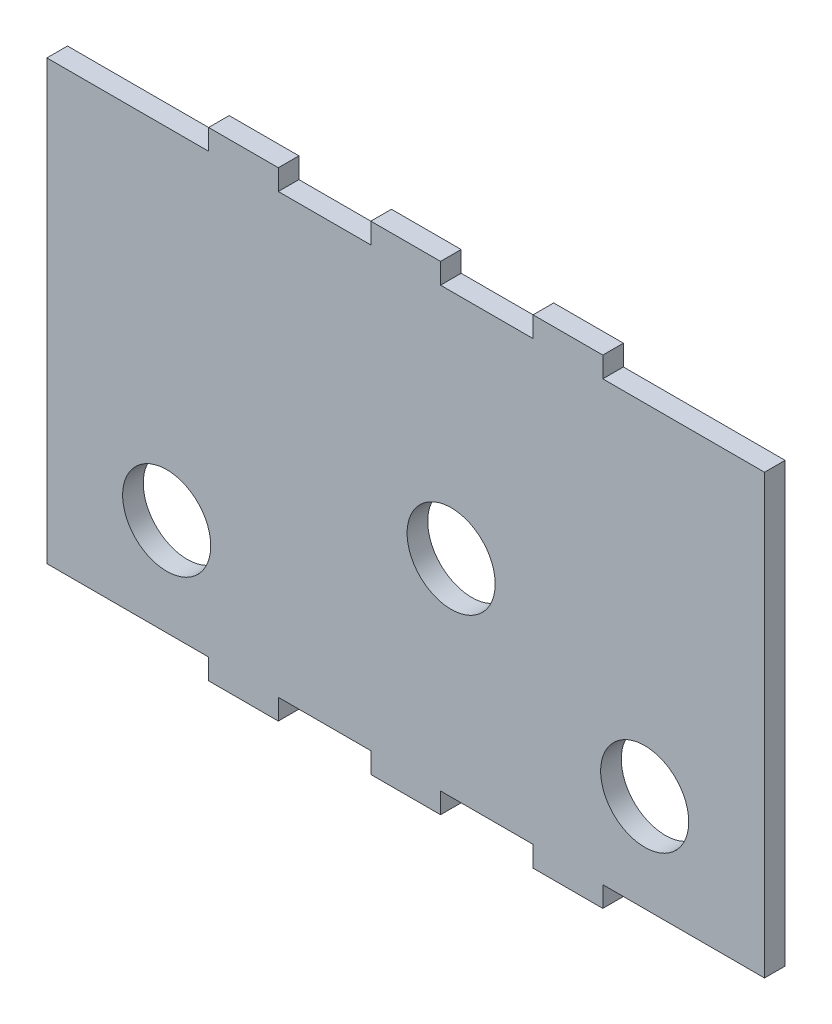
ISO-10303-21;
HEADER;
FILE_DESCRIPTION(('STEP AP214'),'2;1');
FILE_NAME('part.step','',(''),(''),'','','');
FILE_SCHEMA(('AUTOMOTIVE_DESIGN { 1 0 10303 214 1 1 1 1 }'));
ENDSEC;
DATA;
#1=APPLICATION_CONTEXT('core data for automotive mechanical design processes');
#2=APPLICATION_PROTOCOL_DEFINITION('international standard','automotive_design',2000,#1);
#3=PRODUCT_CONTEXT('',#1,'mechanical');
#4=PRODUCT('Part','Part','',(#3));
#5=PRODUCT_RELATED_PRODUCT_CATEGORY('part','',(#4));
#6=PRODUCT_DEFINITION_FORMATION('','',#4);
#7=PRODUCT_DEFINITION_CONTEXT('part definition',#1,'design');
#8=PRODUCT_DEFINITION('design','',#6,#7);
#9=PRODUCT_DEFINITION_SHAPE('','',#8);
#10=(LENGTH_UNIT() NAMED_UNIT(*) SI_UNIT(.MILLI.,.METRE.));
#11=(NAMED_UNIT(*) PLANE_ANGLE_UNIT() SI_UNIT($,.RADIAN.));
#12=(NAMED_UNIT(*) SI_UNIT($,.STERADIAN.) SOLID_ANGLE_UNIT());
#13=UNCERTAINTY_MEASURE_WITH_UNIT(LENGTH_MEASURE(1.E-05),#10,'distance_accuracy_value','');
#14=(GEOMETRIC_REPRESENTATION_CONTEXT(3) GLOBAL_UNCERTAINTY_ASSIGNED_CONTEXT((#13)) GLOBAL_UNIT_ASSIGNED_CONTEXT((#10,
#11,#12)) REPRESENTATION_CONTEXT('',''));
#15=CARTESIAN_POINT('',(0.,0.,0.));
#16=DIRECTION('',(0.,0.,1.));
#17=DIRECTION('',(1.,0.,0.));
#18=AXIS2_PLACEMENT_3D('',#15,#16,#17);
#19=CARTESIAN_POINT('',(0.,0.,6.35));
#20=DIRECTION('',(0.,0.,1.));
#21=DIRECTION('',(1.,0.,0.));
#22=AXIS2_PLACEMENT_3D('',#19,#20,#21);
#23=PLANE('',#22);
#24=CARTESIAN_POINT('',(184.2425,30.,6.35));
#25=DIRECTION('',(0.,0.,1.));
#26=DIRECTION('',(1.,0.,0.));
#27=AXIS2_PLACEMENT_3D('',#24,#25,#26);
#28=CIRCLE('',#27,13.575);
#29=CARTESIAN_POINT('',(197.8175,30.,6.35));
#30=VERTEX_POINT('',#29);
#31=EDGE_CURVE('E586',#30,#30,#28,.T.);
#32=ORIENTED_EDGE('',*,*,#31,.F.);
#33=EDGE_LOOP('',(#32));
#34=FACE_BOUND('',#33,.T.);
#35=DIRECTION('',(1.,0.,0.));
#36=VECTOR('',#35,1.);
#37=CARTESIAN_POINT('',(99.84,0.,6.35));
#38=LINE('',#37,#36);
#39=CARTESIAN_POINT('',(71.325,0.,6.35));
#40=VERTEX_POINT('',#39);
#41=CARTESIAN_POINT('',(99.84,0.,6.35));
#42=VERTEX_POINT('',#41);
#43=EDGE_CURVE('E347',#40,#42,#38,.T.);
#44=ORIENTED_EDGE('',*,*,#43,.T.);
#45=DIRECTION('',(0.,-1.,0.));
#46=VECTOR('',#45,1.);
#47=CARTESIAN_POINT('',(99.84,0.,6.35));
#48=LINE('',#47,#46);
#49=CARTESIAN_POINT('',(99.84,-6.34999999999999,6.35));
#50=VERTEX_POINT('',#49);
#51=EDGE_CURVE('E163',#42,#50,#48,.T.);
#52=ORIENTED_EDGE('',*,*,#51,.T.);
#53=DIRECTION('',(1.,0.,0.));
#54=VECTOR('',#53,1.);
#55=CARTESIAN_POINT('',(99.84,-6.34999999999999,6.35));
#56=LINE('',#55,#54);
#57=CARTESIAN_POINT('',(121.325,-6.34999999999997,6.35));
#58=VERTEX_POINT('',#57);
#59=EDGE_CURVE('E448',#50,#58,#56,.T.);
#60=ORIENTED_EDGE('',*,*,#59,.T.);
#61=DIRECTION('',(0.,1.,0.));
#62=VECTOR('',#61,1.);
#63=CARTESIAN_POINT('',(121.325,-6.34999999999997,6.35));
#64=LINE('',#63,#62);
#65=CARTESIAN_POINT('',(121.325,0.,6.35));
#66=VERTEX_POINT('',#65);
#67=EDGE_CURVE('E468',#58,#66,#64,.T.);
#68=ORIENTED_EDGE('',*,*,#67,.T.);
#69=DIRECTION('',(1.,0.,0.));
#70=VECTOR('',#69,1.);
#71=CARTESIAN_POINT('',(121.325,0.,6.35));
#72=LINE('',#71,#70);
#73=CARTESIAN_POINT('',(149.84,0.,6.35));
#74=VERTEX_POINT('',#73);
#75=EDGE_CURVE('E464',#66,#74,#72,.T.);
#76=ORIENTED_EDGE('',*,*,#75,.T.);
#77=DIRECTION('',(0.,-1.,0.));
#78=VECTOR('',#77,1.);
#79=CARTESIAN_POINT('',(149.84,0.,6.35));
#80=LINE('',#79,#78);
#81=CARTESIAN_POINT('',(149.84,-6.35000000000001,6.35));
#82=VERTEX_POINT('',#81);
#83=EDGE_CURVE('E467',#74,#82,#80,.T.);
#84=ORIENTED_EDGE('',*,*,#83,.T.);
#85=DIRECTION('',(1.,0.,0.));
#86=VECTOR('',#85,1.);
#87=CARTESIAN_POINT('',(149.84,-6.35000000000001,6.35));
#88=LINE('',#87,#86);
#89=CARTESIAN_POINT('',(171.325,-6.35000000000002,6.35));
#90=VERTEX_POINT('',#89);
#91=EDGE_CURVE('E472',#82,#90,#88,.T.);
#92=ORIENTED_EDGE('',*,*,#91,.T.);
#93=DIRECTION('',(0.,1.,0.));
#94=VECTOR('',#93,1.);
#95=CARTESIAN_POINT('',(171.325,-6.35000000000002,6.35));
#96=LINE('',#95,#94);
#97=CARTESIAN_POINT('',(171.325,0.,6.35));
#98=VERTEX_POINT('',#97);
#99=EDGE_CURVE('E479',#90,#98,#96,.T.);
#100=ORIENTED_EDGE('',*,*,#99,.T.);
#101=DIRECTION('',(1.,0.,0.));
#102=VECTOR('',#101,1.);
#103=CARTESIAN_POINT('',(171.325,0.,6.35));
#104=LINE('',#103,#102);
#105=CARTESIAN_POINT('',(221.165,0.,6.35));
#106=VERTEX_POINT('',#105);
#107=EDGE_CURVE('E482',#98,#106,#104,.T.);
#108=ORIENTED_EDGE('',*,*,#107,.T.);
#109=DIRECTION('',(0.,1.,0.));
#110=VECTOR('',#109,1.);
#111=CARTESIAN_POINT('',(221.165,0.,6.35));
#112=LINE('',#111,#110);
#113=CARTESIAN_POINT('',(221.165,135.,6.35));
#114=VERTEX_POINT('',#113);
#115=EDGE_CURVE('E485',#106,#114,#112,.T.);
#116=ORIENTED_EDGE('',*,*,#115,.T.);
#117=DIRECTION('',(-1.,0.,0.));
#118=VECTOR('',#117,1.);
#119=CARTESIAN_POINT('',(171.325,135.,6.35));
#120=LINE('',#119,#118);
#121=CARTESIAN_POINT('',(171.325,135.,6.35));
#122=VERTEX_POINT('',#121);
#123=EDGE_CURVE('E488',#114,#122,#120,.T.);
#124=ORIENTED_EDGE('',*,*,#123,.T.);
#125=DIRECTION('',(0.,1.,0.));
#126=VECTOR('',#125,1.);
#127=CARTESIAN_POINT('',(171.325,141.35,6.35));
#128=LINE('',#127,#126);
#129=CARTESIAN_POINT('',(171.325,141.35,6.35));
#130=VERTEX_POINT('',#129);
#131=EDGE_CURVE('E491',#122,#130,#128,.T.);
#132=ORIENTED_EDGE('',*,*,#131,.T.);
#133=DIRECTION('',(-1.,0.,0.));
#134=VECTOR('',#133,1.);
#135=CARTESIAN_POINT('',(149.84,141.35,6.35));
#136=LINE('',#135,#134);
#137=CARTESIAN_POINT('',(149.84,141.35,6.35));
#138=VERTEX_POINT('',#137);
#139=EDGE_CURVE('E494',#130,#138,#136,.T.);
#140=ORIENTED_EDGE('',*,*,#139,.T.);
#141=DIRECTION('',(0.,-1.,0.));
#142=VECTOR('',#141,1.);
#143=CARTESIAN_POINT('',(149.84,135.,6.35));
#144=LINE('',#143,#142);
#145=CARTESIAN_POINT('',(149.84,135.,6.35));
#146=VERTEX_POINT('',#145);
#147=EDGE_CURVE('E497',#138,#146,#144,.T.);
#148=ORIENTED_EDGE('',*,*,#147,.T.);
#149=DIRECTION('',(-1.,0.,0.));
#150=VECTOR('',#149,1.);
#151=CARTESIAN_POINT('',(121.325,135.,6.35));
#152=LINE('',#151,#150);
#153=CARTESIAN_POINT('',(121.325,135.,6.35));
#154=VERTEX_POINT('',#153);
#155=EDGE_CURVE('E500',#146,#154,#152,.T.);
#156=ORIENTED_EDGE('',*,*,#155,.T.);
#157=DIRECTION('',(0.,1.,0.));
#158=VECTOR('',#157,1.);
#159=CARTESIAN_POINT('',(121.325,141.35,6.35));
#160=LINE('',#159,#158);
#161=CARTESIAN_POINT('',(121.325,141.35,6.35));
#162=VERTEX_POINT('',#161);
#163=EDGE_CURVE('E503',#154,#162,#160,.T.);
#164=ORIENTED_EDGE('',*,*,#163,.T.);
#165=DIRECTION('',(-1.,0.,0.));
#166=VECTOR('',#165,1.);
#167=CARTESIAN_POINT('',(99.8399999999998,141.35,6.35));
#168=LINE('',#167,#166);
#169=CARTESIAN_POINT('',(99.8399999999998,141.35,6.35));
#170=VERTEX_POINT('',#169);
#171=EDGE_CURVE('E506',#162,#170,#168,.T.);
#172=ORIENTED_EDGE('',*,*,#171,.T.);
#173=DIRECTION('',(0.,-1.,0.));
#174=VECTOR('',#173,1.);
#175=CARTESIAN_POINT('',(99.8399999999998,135.,6.35));
#176=LINE('',#175,#174);
#177=CARTESIAN_POINT('',(99.8399999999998,135.,6.35));
#178=VERTEX_POINT('',#177);
#179=EDGE_CURVE('E509',#170,#178,#176,.T.);
#180=ORIENTED_EDGE('',*,*,#179,.T.);
#181=DIRECTION('',(-1.,0.,0.));
#182=VECTOR('',#181,1.);
#183=CARTESIAN_POINT('',(99.8399999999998,135.,6.35));
#184=LINE('',#183,#182);
#185=CARTESIAN_POINT('',(71.3249999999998,135.,6.35));
#186=VERTEX_POINT('',#185);
#187=EDGE_CURVE('E512',#178,#186,#184,.T.);
#188=ORIENTED_EDGE('',*,*,#187,.T.);
#189=DIRECTION('',(0.,1.,0.));
#190=VECTOR('',#189,1.);
#191=CARTESIAN_POINT('',(71.3249999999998,135.,6.35));
#192=LINE('',#191,#190);
#193=CARTESIAN_POINT('',(71.325,141.35,6.35));
#194=VERTEX_POINT('',#193);
#195=EDGE_CURVE('E515',#186,#194,#192,.T.);
#196=ORIENTED_EDGE('',*,*,#195,.T.);
#197=DIRECTION('',(-1.,0.,0.));
#198=VECTOR('',#197,1.);
#199=CARTESIAN_POINT('',(71.325,141.35,6.35));
#200=LINE('',#199,#198);
#201=CARTESIAN_POINT('',(49.84,141.35,6.35));
#202=VERTEX_POINT('',#201);
#203=EDGE_CURVE('E518',#194,#202,#200,.T.);
#204=ORIENTED_EDGE('',*,*,#203,.T.);
#205=DIRECTION('',(0.,-1.,0.));
#206=VECTOR('',#205,1.);
#207=CARTESIAN_POINT('',(49.84,141.35,6.35));
#208=LINE('',#207,#206);
#209=CARTESIAN_POINT('',(49.8399999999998,135.,6.35));
#210=VERTEX_POINT('',#209);
#211=EDGE_CURVE('E521',#202,#210,#208,.T.);
#212=ORIENTED_EDGE('',*,*,#211,.T.);
#213=DIRECTION('',(-1.,0.,0.));
#214=VECTOR('',#213,1.);
#215=CARTESIAN_POINT('',(49.8399999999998,135.,6.35));
#216=LINE('',#215,#214);
#217=CARTESIAN_POINT('',(0.,135.,6.35));
#218=VERTEX_POINT('',#217);
#219=EDGE_CURVE('E524',#210,#218,#216,.T.);
#220=ORIENTED_EDGE('',*,*,#219,.T.);
#221=DIRECTION('',(0.,-1.,0.));
#222=VECTOR('',#221,1.);
#223=CARTESIAN_POINT('',(0.,0.,6.35));
#224=LINE('',#223,#222);
#225=CARTESIAN_POINT('',(0.,0.,6.35));
#226=VERTEX_POINT('',#225);
#227=EDGE_CURVE('E527',#218,#226,#224,.T.);
#228=ORIENTED_EDGE('',*,*,#227,.T.);
#229=DIRECTION('',(1.,0.,0.));
#230=VECTOR('',#229,1.);
#231=CARTESIAN_POINT('',(49.84,0.,6.35));
#232=LINE('',#231,#230);
#233=CARTESIAN_POINT('',(49.84,0.,6.35));
#234=VERTEX_POINT('',#233);
#235=EDGE_CURVE('E242',#226,#234,#232,.T.);
#236=ORIENTED_EDGE('',*,*,#235,.T.);
#237=DIRECTION('',(0.,-1.,0.));
#238=VECTOR('',#237,1.);
#239=CARTESIAN_POINT('',(49.84,-6.35000000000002,6.35));
#240=LINE('',#239,#238);
#241=CARTESIAN_POINT('',(49.84,-6.35000000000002,6.35));
#242=VERTEX_POINT('',#241);
#243=EDGE_CURVE('E236',#234,#242,#240,.T.);
#244=ORIENTED_EDGE('',*,*,#243,.T.);
#245=DIRECTION('',(1.,0.,0.));
#246=VECTOR('',#245,1.);
#247=CARTESIAN_POINT('',(71.325,-6.34999999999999,6.35));
#248=LINE('',#247,#246);
#249=CARTESIAN_POINT('',(71.325,-6.34999999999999,6.35));
#250=VERTEX_POINT('',#249);
#251=EDGE_CURVE('E240',#242,#250,#248,.T.);
#252=ORIENTED_EDGE('',*,*,#251,.T.);
#253=DIRECTION('',(0.,1.,0.));
#254=VECTOR('',#253,1.);
#255=CARTESIAN_POINT('',(71.325,0.,6.35));
#256=LINE('',#255,#254);
#257=EDGE_CURVE('E60',#250,#40,#256,.T.);
#258=ORIENTED_EDGE('',*,*,#257,.T.);
#259=EDGE_LOOP('',(#44,#52,#60,#68,#76,#84,#92,#100,#108,#116,#124,#132,#140,#148,#156,#164,
#172,#180,#188,#196,#204,#212,#220,#228,#236,#244,#252,#258));
#260=FACE_BOUND('',#259,.T.);
#261=CARTESIAN_POINT('',(36.9225,30.,6.35));
#262=DIRECTION('',(0.,0.,1.));
#263=DIRECTION('',(1.,0.,0.));
#264=AXIS2_PLACEMENT_3D('',#261,#262,#263);
#265=CIRCLE('',#264,13.575);
#266=CARTESIAN_POINT('',(50.4975,30.,6.35));
#267=VERTEX_POINT('',#266);
#268=EDGE_CURVE('E269',#267,#267,#265,.T.);
#269=ORIENTED_EDGE('',*,*,#268,.F.);
#270=EDGE_LOOP('',(#269));
#271=FACE_BOUND('',#270,.T.);
#272=CARTESIAN_POINT('',(124.588874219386,63.6703865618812,6.35));
#273=DIRECTION('',(0.,0.,1.));
#274=DIRECTION('',(1.,0.,0.));
#275=AXIS2_PLACEMENT_3D('',#272,#273,#274);
#276=CIRCLE('',#275,13.575);
#277=CARTESIAN_POINT('',(138.163874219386,63.6703865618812,6.35));
#278=VERTEX_POINT('',#277);
#279=EDGE_CURVE('E575',#278,#278,#276,.T.);
#280=ORIENTED_EDGE('',*,*,#279,.F.);
#281=EDGE_LOOP('',(#280));
#282=FACE_BOUND('',#281,.T.);
#283=ADVANCED_FACE('F42',(#34,#260,#271,#282),#23,.T.);
#284=CARTESIAN_POINT('',(0.,0.,0.));
#285=DIRECTION('',(0.,0.,1.));
#286=DIRECTION('',(1.,0.,0.));
#287=AXIS2_PLACEMENT_3D('',#284,#285,#286);
#288=PLANE('',#287);
#289=DIRECTION('',(1.,0.,0.));
#290=VECTOR('',#289,1.);
#291=CARTESIAN_POINT('',(99.84,0.,0.));
#292=LINE('',#291,#290);
#293=CARTESIAN_POINT('',(71.325,0.,0.));
#294=VERTEX_POINT('',#293);
#295=CARTESIAN_POINT('',(99.84,0.,0.));
#296=VERTEX_POINT('',#295);
#297=EDGE_CURVE('E264',#294,#296,#292,.T.);
#298=ORIENTED_EDGE('',*,*,#297,.F.);
#299=DIRECTION('',(0.,1.,0.));
#300=VECTOR('',#299,1.);
#301=CARTESIAN_POINT('',(71.325,0.,0.));
#302=LINE('',#301,#300);
#303=CARTESIAN_POINT('',(71.325,-6.34999999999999,0.));
#304=VERTEX_POINT('',#303);
#305=EDGE_CURVE('E155',#304,#294,#302,.T.);
#306=ORIENTED_EDGE('',*,*,#305,.F.);
#307=DIRECTION('',(1.,0.,0.));
#308=VECTOR('',#307,1.);
#309=CARTESIAN_POINT('',(71.325,-6.34999999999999,0.));
#310=LINE('',#309,#308);
#311=CARTESIAN_POINT('',(49.84,-6.35000000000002,0.));
#312=VERTEX_POINT('',#311);
#313=EDGE_CURVE('E149',#312,#304,#310,.T.);
#314=ORIENTED_EDGE('',*,*,#313,.F.);
#315=DIRECTION('',(0.,-1.,0.));
#316=VECTOR('',#315,1.);
#317=CARTESIAN_POINT('',(49.84,-6.35000000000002,0.));
#318=LINE('',#317,#316);
#319=CARTESIAN_POINT('',(49.84,0.,0.));
#320=VERTEX_POINT('',#319);
#321=EDGE_CURVE('E251',#320,#312,#318,.T.);
#322=ORIENTED_EDGE('',*,*,#321,.F.);
#323=DIRECTION('',(1.,0.,0.));
#324=VECTOR('',#323,1.);
#325=CARTESIAN_POINT('',(49.84,0.,0.));
#326=LINE('',#325,#324);
#327=CARTESIAN_POINT('',(0.,0.,0.));
#328=VERTEX_POINT('',#327);
#329=EDGE_CURVE('E338',#328,#320,#326,.T.);
#330=ORIENTED_EDGE('',*,*,#329,.F.);
#331=DIRECTION('',(0.,-1.,0.));
#332=VECTOR('',#331,1.);
#333=CARTESIAN_POINT('',(0.,0.,0.));
#334=LINE('',#333,#332);
#335=CARTESIAN_POINT('',(0.,135.,0.));
#336=VERTEX_POINT('',#335);
#337=EDGE_CURVE('E335',#336,#328,#334,.T.);
#338=ORIENTED_EDGE('',*,*,#337,.F.);
#339=DIRECTION('',(-1.,0.,0.));
#340=VECTOR('',#339,1.);
#341=CARTESIAN_POINT('',(49.8399999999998,135.,0.));
#342=LINE('',#341,#340);
#343=CARTESIAN_POINT('',(49.8399999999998,135.,0.));
#344=VERTEX_POINT('',#343);
#345=EDGE_CURVE('E332',#344,#336,#342,.T.);
#346=ORIENTED_EDGE('',*,*,#345,.F.);
#347=DIRECTION('',(0.,-1.,0.));
#348=VECTOR('',#347,1.);
#349=CARTESIAN_POINT('',(49.84,141.35,0.));
#350=LINE('',#349,#348);
#351=CARTESIAN_POINT('',(49.84,141.35,0.));
#352=VERTEX_POINT('',#351);
#353=EDGE_CURVE('E329',#352,#344,#350,.T.);
#354=ORIENTED_EDGE('',*,*,#353,.F.);
#355=DIRECTION('',(-1.,0.,0.));
#356=VECTOR('',#355,1.);
#357=CARTESIAN_POINT('',(71.325,141.35,0.));
#358=LINE('',#357,#356);
#359=CARTESIAN_POINT('',(71.325,141.35,0.));
#360=VERTEX_POINT('',#359);
#361=EDGE_CURVE('E326',#360,#352,#358,.T.);
#362=ORIENTED_EDGE('',*,*,#361,.F.);
#363=DIRECTION('',(0.,1.,0.));
#364=VECTOR('',#363,1.);
#365=CARTESIAN_POINT('',(71.3249999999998,135.,0.));
#366=LINE('',#365,#364);
#367=CARTESIAN_POINT('',(71.3249999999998,135.,0.));
#368=VERTEX_POINT('',#367);
#369=EDGE_CURVE('E323',#368,#360,#366,.T.);
#370=ORIENTED_EDGE('',*,*,#369,.F.);
#371=DIRECTION('',(-1.,0.,0.));
#372=VECTOR('',#371,1.);
#373=CARTESIAN_POINT('',(99.8399999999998,135.,0.));
#374=LINE('',#373,#372);
#375=CARTESIAN_POINT('',(99.8399999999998,135.,0.));
#376=VERTEX_POINT('',#375);
#377=EDGE_CURVE('E320',#376,#368,#374,.T.);
#378=ORIENTED_EDGE('',*,*,#377,.F.);
#379=DIRECTION('',(0.,-1.,0.));
#380=VECTOR('',#379,1.);
#381=CARTESIAN_POINT('',(99.8399999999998,135.,0.));
#382=LINE('',#381,#380);
#383=CARTESIAN_POINT('',(99.8399999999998,141.35,0.));
#384=VERTEX_POINT('',#383);
#385=EDGE_CURVE('E317',#384,#376,#382,.T.);
#386=ORIENTED_EDGE('',*,*,#385,.F.);
#387=DIRECTION('',(-1.,0.,0.));
#388=VECTOR('',#387,1.);
#389=CARTESIAN_POINT('',(99.8399999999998,141.35,0.));
#390=LINE('',#389,#388);
#391=CARTESIAN_POINT('',(121.325,141.35,0.));
#392=VERTEX_POINT('',#391);
#393=EDGE_CURVE('E314',#392,#384,#390,.T.);
#394=ORIENTED_EDGE('',*,*,#393,.F.);
#395=DIRECTION('',(0.,1.,0.));
#396=VECTOR('',#395,1.);
#397=CARTESIAN_POINT('',(121.325,141.35,0.));
#398=LINE('',#397,#396);
#399=CARTESIAN_POINT('',(121.325,135.,0.));
#400=VERTEX_POINT('',#399);
#401=EDGE_CURVE('E311',#400,#392,#398,.T.);
#402=ORIENTED_EDGE('',*,*,#401,.F.);
#403=DIRECTION('',(-1.,0.,0.));
#404=VECTOR('',#403,1.);
#405=CARTESIAN_POINT('',(121.325,135.,0.));
#406=LINE('',#405,#404);
#407=CARTESIAN_POINT('',(149.84,135.,0.));
#408=VERTEX_POINT('',#407);
#409=EDGE_CURVE('E308',#408,#400,#406,.T.);
#410=ORIENTED_EDGE('',*,*,#409,.F.);
#411=DIRECTION('',(0.,-1.,0.));
#412=VECTOR('',#411,1.);
#413=CARTESIAN_POINT('',(149.84,135.,0.));
#414=LINE('',#413,#412);
#415=CARTESIAN_POINT('',(149.84,141.35,0.));
#416=VERTEX_POINT('',#415);
#417=EDGE_CURVE('E305',#416,#408,#414,.T.);
#418=ORIENTED_EDGE('',*,*,#417,.F.);
#419=DIRECTION('',(-1.,0.,0.));
#420=VECTOR('',#419,1.);
#421=CARTESIAN_POINT('',(149.84,141.35,0.));
#422=LINE('',#421,#420);
#423=CARTESIAN_POINT('',(171.325,141.35,0.));
#424=VERTEX_POINT('',#423);
#425=EDGE_CURVE('E302',#424,#416,#422,.T.);
#426=ORIENTED_EDGE('',*,*,#425,.F.);
#427=DIRECTION('',(0.,1.,0.));
#428=VECTOR('',#427,1.);
#429=CARTESIAN_POINT('',(171.325,141.35,0.));
#430=LINE('',#429,#428);
#431=CARTESIAN_POINT('',(171.325,135.,0.));
#432=VERTEX_POINT('',#431);
#433=EDGE_CURVE('E299',#432,#424,#430,.T.);
#434=ORIENTED_EDGE('',*,*,#433,.F.);
#435=DIRECTION('',(-1.,0.,0.));
#436=VECTOR('',#435,1.);
#437=CARTESIAN_POINT('',(171.325,135.,0.));
#438=LINE('',#437,#436);
#439=CARTESIAN_POINT('',(221.165,135.,0.));
#440=VERTEX_POINT('',#439);
#441=EDGE_CURVE('E296',#440,#432,#438,.T.);
#442=ORIENTED_EDGE('',*,*,#441,.F.);
#443=DIRECTION('',(0.,1.,0.));
#444=VECTOR('',#443,1.);
#445=CARTESIAN_POINT('',(221.165,0.,0.));
#446=LINE('',#445,#444);
#447=CARTESIAN_POINT('',(221.165,0.,0.));
#448=VERTEX_POINT('',#447);
#449=EDGE_CURVE('E293',#448,#440,#446,.T.);
#450=ORIENTED_EDGE('',*,*,#449,.F.);
#451=DIRECTION('',(1.,0.,0.));
#452=VECTOR('',#451,1.);
#453=CARTESIAN_POINT('',(171.325,0.,0.));
#454=LINE('',#453,#452);
#455=CARTESIAN_POINT('',(171.325,0.,0.));
#456=VERTEX_POINT('',#455);
#457=EDGE_CURVE('E290',#456,#448,#454,.T.);
#458=ORIENTED_EDGE('',*,*,#457,.F.);
#459=DIRECTION('',(0.,1.,0.));
#460=VECTOR('',#459,1.);
#461=CARTESIAN_POINT('',(171.325,-6.35000000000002,0.));
#462=LINE('',#461,#460);
#463=CARTESIAN_POINT('',(171.325,-6.35000000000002,0.));
#464=VERTEX_POINT('',#463);
#465=EDGE_CURVE('E287',#464,#456,#462,.T.);
#466=ORIENTED_EDGE('',*,*,#465,.F.);
#467=DIRECTION('',(1.,0.,0.));
#468=VECTOR('',#467,1.);
#469=CARTESIAN_POINT('',(149.84,-6.35000000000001,0.));
#470=LINE('',#469,#468);
#471=CARTESIAN_POINT('',(149.84,-6.35000000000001,0.));
#472=VERTEX_POINT('',#471);
#473=EDGE_CURVE('E284',#472,#464,#470,.T.);
#474=ORIENTED_EDGE('',*,*,#473,.F.);
#475=DIRECTION('',(0.,-1.,0.));
#476=VECTOR('',#475,1.);
#477=CARTESIAN_POINT('',(149.84,0.,0.));
#478=LINE('',#477,#476);
#479=CARTESIAN_POINT('',(149.84,0.,0.));
#480=VERTEX_POINT('',#479);
#481=EDGE_CURVE('E281',#480,#472,#478,.T.);
#482=ORIENTED_EDGE('',*,*,#481,.F.);
#483=DIRECTION('',(1.,0.,0.));
#484=VECTOR('',#483,1.);
#485=CARTESIAN_POINT('',(121.325,0.,0.));
#486=LINE('',#485,#484);
#487=CARTESIAN_POINT('',(121.325,0.,0.));
#488=VERTEX_POINT('',#487);
#489=EDGE_CURVE('E278',#488,#480,#486,.T.);
#490=ORIENTED_EDGE('',*,*,#489,.F.);
#491=DIRECTION('',(0.,1.,0.));
#492=VECTOR('',#491,1.);
#493=CARTESIAN_POINT('',(121.325,-6.34999999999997,0.));
#494=LINE('',#493,#492);
#495=CARTESIAN_POINT('',(121.325,-6.34999999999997,0.));
#496=VERTEX_POINT('',#495);
#497=EDGE_CURVE('E275',#496,#488,#494,.T.);
#498=ORIENTED_EDGE('',*,*,#497,.F.);
#499=DIRECTION('',(1.,0.,0.));
#500=VECTOR('',#499,1.);
#501=CARTESIAN_POINT('',(99.84,-6.34999999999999,0.));
#502=LINE('',#501,#500);
#503=CARTESIAN_POINT('',(99.84,-6.34999999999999,0.));
#504=VERTEX_POINT('',#503);
#505=EDGE_CURVE('E272',#504,#496,#502,.T.);
#506=ORIENTED_EDGE('',*,*,#505,.F.);
#507=DIRECTION('',(0.,-1.,0.));
#508=VECTOR('',#507,1.);
#509=CARTESIAN_POINT('',(99.84,0.,0.));
#510=LINE('',#509,#508);
#511=EDGE_CURVE('E268',#296,#504,#510,.T.);
#512=ORIENTED_EDGE('',*,*,#511,.F.);
#513=EDGE_LOOP('',(#298,#306,#314,#322,#330,#338,#346,#354,#362,#370,#378,#386,#394,#402,#410,
#418,#426,#434,#442,#450,#458,#466,#474,#482,#490,#498,#506,#512));
#514=FACE_BOUND('',#513,.T.);
#515=CARTESIAN_POINT('',(36.9225,30.,0.));
#516=DIRECTION('',(0.,0.,1.));
#517=DIRECTION('',(1.,0.,0.));
#518=AXIS2_PLACEMENT_3D('',#515,#516,#517);
#519=CIRCLE('',#518,13.575);
#520=CARTESIAN_POINT('',(50.4975,30.,0.));
#521=VERTEX_POINT('',#520);
#522=EDGE_CURVE('E590',#521,#521,#519,.T.);
#523=ORIENTED_EDGE('',*,*,#522,.T.);
#524=EDGE_LOOP('',(#523));
#525=FACE_BOUND('',#524,.T.);
#526=CARTESIAN_POINT('',(184.2425,30.,0.));
#527=DIRECTION('',(0.,0.,1.));
#528=DIRECTION('',(1.,0.,0.));
#529=AXIS2_PLACEMENT_3D('',#526,#527,#528);
#530=CIRCLE('',#529,13.575);
#531=CARTESIAN_POINT('',(197.8175,30.,0.));
#532=VERTEX_POINT('',#531);
#533=EDGE_CURVE('E583',#532,#532,#530,.T.);
#534=ORIENTED_EDGE('',*,*,#533,.T.);
#535=EDGE_LOOP('',(#534));
#536=FACE_BOUND('',#535,.T.);
#537=CARTESIAN_POINT('',(124.588874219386,63.6703865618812,0.));
#538=DIRECTION('',(0.,0.,1.));
#539=DIRECTION('',(1.,0.,0.));
#540=AXIS2_PLACEMENT_3D('',#537,#538,#539);
#541=CIRCLE('',#540,13.575);
#542=CARTESIAN_POINT('',(138.163874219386,63.6703865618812,0.));
#543=VERTEX_POINT('',#542);
#544=EDGE_CURVE('E578',#543,#543,#541,.T.);
#545=ORIENTED_EDGE('',*,*,#544,.T.);
#546=EDGE_LOOP('',(#545));
#547=FACE_BOUND('',#546,.T.);
#548=ADVANCED_FACE('F452',(#514,#525,#536,#547),#288,.F.);
#549=CARTESIAN_POINT('',(99.84,0.,6.35));
#550=DIRECTION('',(0.,1.,0.));
#551=DIRECTION('',(-1.,0.,0.));
#552=AXIS2_PLACEMENT_3D('',#549,#550,#551);
#553=PLANE('',#552);
#554=ORIENTED_EDGE('',*,*,#297,.T.);
#555=DIRECTION('',(0.,0.,-1.));
#556=VECTOR('',#555,1.);
#557=CARTESIAN_POINT('',(99.84,0.,6.35));
#558=LINE('',#557,#556);
#559=EDGE_CURVE('E11',#42,#296,#558,.T.);
#560=ORIENTED_EDGE('',*,*,#559,.F.);
#561=ORIENTED_EDGE('',*,*,#43,.F.);
#562=DIRECTION('',(0.,0.,-1.));
#563=VECTOR('',#562,1.);
#564=CARTESIAN_POINT('',(71.325,0.,6.35));
#565=LINE('',#564,#563);
#566=EDGE_CURVE('E260',#40,#294,#565,.T.);
#567=ORIENTED_EDGE('',*,*,#566,.T.);
#568=EDGE_LOOP('',(#554,#560,#561,#567));
#569=FACE_BOUND('',#568,.T.);
#570=ADVANCED_FACE('F44',(#569),#553,.F.);
#571=CARTESIAN_POINT('',(99.84,0.,6.35));
#572=DIRECTION('',(1.,0.,0.));
#573=DIRECTION('',(0.,0.,-1.));
#574=AXIS2_PLACEMENT_3D('',#571,#572,#573);
#575=PLANE('',#574);
#576=ORIENTED_EDGE('',*,*,#511,.T.);
#577=DIRECTION('',(0.,0.,-1.));
#578=VECTOR('',#577,1.);
#579=CARTESIAN_POINT('',(99.84,-6.34999999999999,6.35));
#580=LINE('',#579,#578);
#581=EDGE_CURVE('E52',#50,#504,#580,.T.);
#582=ORIENTED_EDGE('',*,*,#581,.F.);
#583=ORIENTED_EDGE('',*,*,#51,.F.);
#584=ORIENTED_EDGE('',*,*,#559,.T.);
#585=EDGE_LOOP('',(#576,#582,#583,#584));
#586=FACE_BOUND('',#585,.T.);
#587=ADVANCED_FACE('F884',(#586),#575,.F.);
#588=CARTESIAN_POINT('',(99.84,-6.34999999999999,6.35));
#589=DIRECTION('',(0.,1.,0.));
#590=DIRECTION('',(-1.,0.,0.));
#591=AXIS2_PLACEMENT_3D('',#588,#589,#590);
#592=PLANE('',#591);
#593=ORIENTED_EDGE('',*,*,#505,.T.);
#594=DIRECTION('',(0.,0.,-1.));
#595=VECTOR('',#594,1.);
#596=CARTESIAN_POINT('',(121.325,-6.34999999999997,6.35));
#597=LINE('',#596,#595);
#598=EDGE_CURVE('E438',#58,#496,#597,.T.);
#599=ORIENTED_EDGE('',*,*,#598,.F.);
#600=ORIENTED_EDGE('',*,*,#59,.F.);
#601=ORIENTED_EDGE('',*,*,#581,.T.);
#602=EDGE_LOOP('',(#593,#599,#600,#601));
#603=FACE_BOUND('',#602,.T.);
#604=ADVANCED_FACE('F446',(#603),#592,.F.);
#605=CARTESIAN_POINT('',(121.325,-6.34999999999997,6.35));
#606=DIRECTION('',(-1.,0.,0.));
#607=DIRECTION('',(0.,-1.,0.));
#608=AXIS2_PLACEMENT_3D('',#605,#606,#607);
#609=PLANE('',#608);
#610=ORIENTED_EDGE('',*,*,#497,.T.);
#611=DIRECTION('',(0.,0.,-1.));
#612=VECTOR('',#611,1.);
#613=CARTESIAN_POINT('',(121.325,0.,6.35));
#614=LINE('',#613,#612);
#615=EDGE_CURVE('E434',#66,#488,#614,.T.);
#616=ORIENTED_EDGE('',*,*,#615,.F.);
#617=ORIENTED_EDGE('',*,*,#67,.F.);
#618=ORIENTED_EDGE('',*,*,#598,.T.);
#619=EDGE_LOOP('',(#610,#616,#617,#618));
#620=FACE_BOUND('',#619,.T.);
#621=ADVANCED_FACE('F458',(#620),#609,.F.);
#622=CARTESIAN_POINT('',(121.325,0.,6.35));
#623=DIRECTION('',(0.,1.,0.));
#624=DIRECTION('',(0.,0.,1.));
#625=AXIS2_PLACEMENT_3D('',#622,#623,#624);
#626=PLANE('',#625);
#627=ORIENTED_EDGE('',*,*,#489,.T.);
#628=DIRECTION('',(0.,0.,-1.));
#629=VECTOR('',#628,1.);
#630=CARTESIAN_POINT('',(149.84,0.,6.35));
#631=LINE('',#630,#629);
#632=EDGE_CURVE('E430',#74,#480,#631,.T.);
#633=ORIENTED_EDGE('',*,*,#632,.F.);
#634=ORIENTED_EDGE('',*,*,#75,.F.);
#635=ORIENTED_EDGE('',*,*,#615,.T.);
#636=EDGE_LOOP('',(#627,#633,#634,#635));
#637=FACE_BOUND('',#636,.T.);
#638=ADVANCED_FACE('F462',(#637),#626,.F.);
#639=CARTESIAN_POINT('',(149.84,0.,6.35));
#640=DIRECTION('',(1.,0.,0.));
#641=DIRECTION('',(0.,0.,-1.));
#642=AXIS2_PLACEMENT_3D('',#639,#640,#641);
#643=PLANE('',#642);
#644=ORIENTED_EDGE('',*,*,#481,.T.);
#645=DIRECTION('',(0.,0.,-1.));
#646=VECTOR('',#645,1.);
#647=CARTESIAN_POINT('',(149.84,-6.35000000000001,6.35));
#648=LINE('',#647,#646);
#649=EDGE_CURVE('E426',#82,#472,#648,.T.);
#650=ORIENTED_EDGE('',*,*,#649,.F.);
#651=ORIENTED_EDGE('',*,*,#83,.F.);
#652=ORIENTED_EDGE('',*,*,#632,.T.);
#653=EDGE_LOOP('',(#644,#650,#651,#652));
#654=FACE_BOUND('',#653,.T.);
#655=ADVANCED_FACE('F845',(#654),#643,.F.);
#656=CARTESIAN_POINT('',(149.84,-6.35000000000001,6.35));
#657=DIRECTION('',(0.,1.,0.));
#658=DIRECTION('',(-1.,0.,0.));
#659=AXIS2_PLACEMENT_3D('',#656,#657,#658);
#660=PLANE('',#659);
#661=ORIENTED_EDGE('',*,*,#473,.T.);
#662=DIRECTION('',(0.,0.,-1.));
#663=VECTOR('',#662,1.);
#664=CARTESIAN_POINT('',(171.325,-6.35000000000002,6.35));
#665=LINE('',#664,#663);
#666=EDGE_CURVE('E422',#90,#464,#665,.T.);
#667=ORIENTED_EDGE('',*,*,#666,.F.);
#668=ORIENTED_EDGE('',*,*,#91,.F.);
#669=ORIENTED_EDGE('',*,*,#649,.T.);
#670=EDGE_LOOP('',(#661,#667,#668,#669));
#671=FACE_BOUND('',#670,.T.);
#672=ADVANCED_FACE('F834',(#671),#660,.F.);
#673=CARTESIAN_POINT('',(171.325,-6.35000000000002,6.35));
#674=DIRECTION('',(-1.,0.,0.));
#675=DIRECTION('',(0.,0.,1.));
#676=AXIS2_PLACEMENT_3D('',#673,#674,#675);
#677=PLANE('',#676);
#678=ORIENTED_EDGE('',*,*,#465,.T.);
#679=DIRECTION('',(0.,0.,-1.));
#680=VECTOR('',#679,1.);
#681=CARTESIAN_POINT('',(171.325,0.,6.35));
#682=LINE('',#681,#680);
#683=EDGE_CURVE('E418',#98,#456,#682,.T.);
#684=ORIENTED_EDGE('',*,*,#683,.F.);
#685=ORIENTED_EDGE('',*,*,#99,.F.);
#686=ORIENTED_EDGE('',*,*,#666,.T.);
#687=EDGE_LOOP('',(#678,#684,#685,#686));
#688=FACE_BOUND('',#687,.T.);
#689=ADVANCED_FACE('F823',(#688),#677,.F.);
#690=CARTESIAN_POINT('',(171.325,0.,6.35));
#691=DIRECTION('',(0.,1.,0.));
#692=DIRECTION('',(-1.,0.,0.));
#693=AXIS2_PLACEMENT_3D('',#690,#691,#692);
#694=PLANE('',#693);
#695=ORIENTED_EDGE('',*,*,#457,.T.);
#696=DIRECTION('',(0.,0.,-1.));
#697=VECTOR('',#696,1.);
#698=CARTESIAN_POINT('',(221.165,0.,6.35));
#699=LINE('',#698,#697);
#700=EDGE_CURVE('E414',#106,#448,#699,.T.);
#701=ORIENTED_EDGE('',*,*,#700,.F.);
#702=ORIENTED_EDGE('',*,*,#107,.F.);
#703=ORIENTED_EDGE('',*,*,#683,.T.);
#704=EDGE_LOOP('',(#695,#701,#702,#703));
#705=FACE_BOUND('',#704,.T.);
#706=ADVANCED_FACE('F812',(#705),#694,.F.);
#707=CARTESIAN_POINT('',(221.165,0.,6.35));
#708=DIRECTION('',(-1.,0.,0.));
#709=DIRECTION('',(0.,-1.,0.));
#710=AXIS2_PLACEMENT_3D('',#707,#708,#709);
#711=PLANE('',#710);
#712=ORIENTED_EDGE('',*,*,#449,.T.);
#713=DIRECTION('',(0.,0.,-1.));
#714=VECTOR('',#713,1.);
#715=CARTESIAN_POINT('',(221.165,135.,6.35));
#716=LINE('',#715,#714);
#717=EDGE_CURVE('E410',#114,#440,#716,.T.);
#718=ORIENTED_EDGE('',*,*,#717,.F.);
#719=ORIENTED_EDGE('',*,*,#115,.F.);
#720=ORIENTED_EDGE('',*,*,#700,.T.);
#721=EDGE_LOOP('',(#712,#718,#719,#720));
#722=FACE_BOUND('',#721,.T.);
#723=ADVANCED_FACE('F801',(#722),#711,.F.);
#724=CARTESIAN_POINT('',(171.325,135.,6.35));
#725=DIRECTION('',(0.,-1.,0.));
#726=DIRECTION('',(1.,0.,0.));
#727=AXIS2_PLACEMENT_3D('',#724,#725,#726);
#728=PLANE('',#727);
#729=ORIENTED_EDGE('',*,*,#441,.T.);
#730=DIRECTION('',(0.,0.,-1.));
#731=VECTOR('',#730,1.);
#732=CARTESIAN_POINT('',(171.325,135.,6.35));
#733=LINE('',#732,#731);
#734=EDGE_CURVE('E406',#122,#432,#733,.T.);
#735=ORIENTED_EDGE('',*,*,#734,.F.);
#736=ORIENTED_EDGE('',*,*,#123,.F.);
#737=ORIENTED_EDGE('',*,*,#717,.T.);
#738=EDGE_LOOP('',(#729,#735,#736,#737));
#739=FACE_BOUND('',#738,.T.);
#740=ADVANCED_FACE('F790',(#739),#728,.F.);
#741=CARTESIAN_POINT('',(171.325,141.35,6.35));
#742=DIRECTION('',(-1.,0.,0.));
#743=DIRECTION('',(0.,-1.,0.));
#744=AXIS2_PLACEMENT_3D('',#741,#742,#743);
#745=PLANE('',#744);
#746=ORIENTED_EDGE('',*,*,#433,.T.);
#747=DIRECTION('',(0.,0.,-1.));
#748=VECTOR('',#747,1.);
#749=CARTESIAN_POINT('',(171.325,141.35,6.35));
#750=LINE('',#749,#748);
#751=EDGE_CURVE('E402',#130,#424,#750,.T.);
#752=ORIENTED_EDGE('',*,*,#751,.F.);
#753=ORIENTED_EDGE('',*,*,#131,.F.);
#754=ORIENTED_EDGE('',*,*,#734,.T.);
#755=EDGE_LOOP('',(#746,#752,#753,#754));
#756=FACE_BOUND('',#755,.T.);
#757=ADVANCED_FACE('F779',(#756),#745,.F.);
#758=CARTESIAN_POINT('',(149.84,141.35,6.35));
#759=DIRECTION('',(0.,-1.,0.));
#760=DIRECTION('',(1.,0.,0.));
#761=AXIS2_PLACEMENT_3D('',#758,#759,#760);
#762=PLANE('',#761);
#763=ORIENTED_EDGE('',*,*,#425,.T.);
#764=DIRECTION('',(0.,0.,-1.));
#765=VECTOR('',#764,1.);
#766=CARTESIAN_POINT('',(149.84,141.35,6.35));
#767=LINE('',#766,#765);
#768=EDGE_CURVE('E398',#138,#416,#767,.T.);
#769=ORIENTED_EDGE('',*,*,#768,.F.);
#770=ORIENTED_EDGE('',*,*,#139,.F.);
#771=ORIENTED_EDGE('',*,*,#751,.T.);
#772=EDGE_LOOP('',(#763,#769,#770,#771));
#773=FACE_BOUND('',#772,.T.);
#774=ADVANCED_FACE('F768',(#773),#762,.F.);
#775=CARTESIAN_POINT('',(149.84,135.,6.35));
#776=DIRECTION('',(1.,0.,0.));
#777=DIRECTION('',(0.,1.,0.));
#778=AXIS2_PLACEMENT_3D('',#775,#776,#777);
#779=PLANE('',#778);
#780=ORIENTED_EDGE('',*,*,#417,.T.);
#781=DIRECTION('',(0.,0.,-1.));
#782=VECTOR('',#781,1.);
#783=CARTESIAN_POINT('',(149.84,135.,6.35));
#784=LINE('',#783,#782);
#785=EDGE_CURVE('E394',#146,#408,#784,.T.);
#786=ORIENTED_EDGE('',*,*,#785,.F.);
#787=ORIENTED_EDGE('',*,*,#147,.F.);
#788=ORIENTED_EDGE('',*,*,#768,.T.);
#789=EDGE_LOOP('',(#780,#786,#787,#788));
#790=FACE_BOUND('',#789,.T.);
#791=ADVANCED_FACE('F757',(#790),#779,.F.);
#792=CARTESIAN_POINT('',(121.325,135.,6.35));
#793=DIRECTION('',(0.,-1.,0.));
#794=DIRECTION('',(1.,0.,0.));
#795=AXIS2_PLACEMENT_3D('',#792,#793,#794);
#796=PLANE('',#795);
#797=ORIENTED_EDGE('',*,*,#409,.T.);
#798=DIRECTION('',(0.,0.,-1.));
#799=VECTOR('',#798,1.);
#800=CARTESIAN_POINT('',(121.325,135.,6.35));
#801=LINE('',#800,#799);
#802=EDGE_CURVE('E390',#154,#400,#801,.T.);
#803=ORIENTED_EDGE('',*,*,#802,.F.);
#804=ORIENTED_EDGE('',*,*,#155,.F.);
#805=ORIENTED_EDGE('',*,*,#785,.T.);
#806=EDGE_LOOP('',(#797,#803,#804,#805));
#807=FACE_BOUND('',#806,.T.);
#808=ADVANCED_FACE('F746',(#807),#796,.F.);
#809=CARTESIAN_POINT('',(121.325,141.35,6.35));
#810=DIRECTION('',(-1.,0.,0.));
#811=DIRECTION('',(0.,0.,1.));
#812=AXIS2_PLACEMENT_3D('',#809,#810,#811);
#813=PLANE('',#812);
#814=ORIENTED_EDGE('',*,*,#401,.T.);
#815=DIRECTION('',(0.,0.,-1.));
#816=VECTOR('',#815,1.);
#817=CARTESIAN_POINT('',(121.325,141.35,6.35));
#818=LINE('',#817,#816);
#819=EDGE_CURVE('E386',#162,#392,#818,.T.);
#820=ORIENTED_EDGE('',*,*,#819,.F.);
#821=ORIENTED_EDGE('',*,*,#163,.F.);
#822=ORIENTED_EDGE('',*,*,#802,.T.);
#823=EDGE_LOOP('',(#814,#820,#821,#822));
#824=FACE_BOUND('',#823,.T.);
#825=ADVANCED_FACE('F735',(#824),#813,.F.);
#826=CARTESIAN_POINT('',(99.8399999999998,141.35,6.35));
#827=DIRECTION('',(0.,-1.,0.));
#828=DIRECTION('',(1.,0.,0.));
#829=AXIS2_PLACEMENT_3D('',#826,#827,#828);
#830=PLANE('',#829);
#831=ORIENTED_EDGE('',*,*,#393,.T.);
#832=DIRECTION('',(0.,0.,-1.));
#833=VECTOR('',#832,1.);
#834=CARTESIAN_POINT('',(99.8399999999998,141.35,6.35));
#835=LINE('',#834,#833);
#836=EDGE_CURVE('E382',#170,#384,#835,.T.);
#837=ORIENTED_EDGE('',*,*,#836,.F.);
#838=ORIENTED_EDGE('',*,*,#171,.F.);
#839=ORIENTED_EDGE('',*,*,#819,.T.);
#840=EDGE_LOOP('',(#831,#837,#838,#839));
#841=FACE_BOUND('',#840,.T.);
#842=ADVANCED_FACE('F724',(#841),#830,.F.);
#843=CARTESIAN_POINT('',(99.8399999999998,135.,6.35));
#844=DIRECTION('',(1.,0.,0.));
#845=DIRECTION('',(0.,0.,-1.));
#846=AXIS2_PLACEMENT_3D('',#843,#844,#845);
#847=PLANE('',#846);
#848=ORIENTED_EDGE('',*,*,#385,.T.);
#849=DIRECTION('',(0.,0.,-1.));
#850=VECTOR('',#849,1.);
#851=CARTESIAN_POINT('',(99.8399999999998,135.,6.35));
#852=LINE('',#851,#850);
#853=EDGE_CURVE('E378',#178,#376,#852,.T.);
#854=ORIENTED_EDGE('',*,*,#853,.F.);
#855=ORIENTED_EDGE('',*,*,#179,.F.);
#856=ORIENTED_EDGE('',*,*,#836,.T.);
#857=EDGE_LOOP('',(#848,#854,#855,#856));
#858=FACE_BOUND('',#857,.T.);
#859=ADVANCED_FACE('F713',(#858),#847,.F.);
#860=CARTESIAN_POINT('',(99.8399999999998,135.,6.35));
#861=DIRECTION('',(0.,-1.,0.));
#862=DIRECTION('',(1.,0.,0.));
#863=AXIS2_PLACEMENT_3D('',#860,#861,#862);
#864=PLANE('',#863);
#865=ORIENTED_EDGE('',*,*,#377,.T.);
#866=DIRECTION('',(0.,0.,-1.));
#867=VECTOR('',#866,1.);
#868=CARTESIAN_POINT('',(71.3249999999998,135.,6.35));
#869=LINE('',#868,#867);
#870=EDGE_CURVE('E374',#186,#368,#869,.T.);
#871=ORIENTED_EDGE('',*,*,#870,.F.);
#872=ORIENTED_EDGE('',*,*,#187,.F.);
#873=ORIENTED_EDGE('',*,*,#853,.T.);
#874=EDGE_LOOP('',(#865,#871,#872,#873));
#875=FACE_BOUND('',#874,.T.);
#876=ADVANCED_FACE('F702',(#875),#864,.F.);
#877=CARTESIAN_POINT('',(71.3249999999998,135.,6.35));
#878=DIRECTION('',(-1.,0.,0.));
#879=DIRECTION('',(0.,-1.,0.));
#880=AXIS2_PLACEMENT_3D('',#877,#878,#879);
#881=PLANE('',#880);
#882=ORIENTED_EDGE('',*,*,#369,.T.);
#883=DIRECTION('',(0.,0.,-1.));
#884=VECTOR('',#883,1.);
#885=CARTESIAN_POINT('',(71.325,141.35,6.35));
#886=LINE('',#885,#884);
#887=EDGE_CURVE('E370',#194,#360,#886,.T.);
#888=ORIENTED_EDGE('',*,*,#887,.F.);
#889=ORIENTED_EDGE('',*,*,#195,.F.);
#890=ORIENTED_EDGE('',*,*,#870,.T.);
#891=EDGE_LOOP('',(#882,#888,#889,#890));
#892=FACE_BOUND('',#891,.T.);
#893=ADVANCED_FACE('F691',(#892),#881,.F.);
#894=CARTESIAN_POINT('',(71.325,141.35,6.35));
#895=DIRECTION('',(0.,-1.,0.));
#896=DIRECTION('',(1.,0.,0.));
#897=AXIS2_PLACEMENT_3D('',#894,#895,#896);
#898=PLANE('',#897);
#899=ORIENTED_EDGE('',*,*,#361,.T.);
#900=DIRECTION('',(0.,0.,-1.));
#901=VECTOR('',#900,1.);
#902=CARTESIAN_POINT('',(49.84,141.35,6.35));
#903=LINE('',#902,#901);
#904=EDGE_CURVE('E366',#202,#352,#903,.T.);
#905=ORIENTED_EDGE('',*,*,#904,.F.);
#906=ORIENTED_EDGE('',*,*,#203,.F.);
#907=ORIENTED_EDGE('',*,*,#887,.T.);
#908=EDGE_LOOP('',(#899,#905,#906,#907));
#909=FACE_BOUND('',#908,.T.);
#910=ADVANCED_FACE('F680',(#909),#898,.F.);
#911=CARTESIAN_POINT('',(49.84,141.35,6.35));
#912=DIRECTION('',(1.,0.,0.));
#913=DIRECTION('',(0.,1.,0.));
#914=AXIS2_PLACEMENT_3D('',#911,#912,#913);
#915=PLANE('',#914);
#916=ORIENTED_EDGE('',*,*,#353,.T.);
#917=DIRECTION('',(0.,0.,-1.));
#918=VECTOR('',#917,1.);
#919=CARTESIAN_POINT('',(49.8399999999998,135.,6.35));
#920=LINE('',#919,#918);
#921=EDGE_CURVE('E362',#210,#344,#920,.T.);
#922=ORIENTED_EDGE('',*,*,#921,.F.);
#923=ORIENTED_EDGE('',*,*,#211,.F.);
#924=ORIENTED_EDGE('',*,*,#904,.T.);
#925=EDGE_LOOP('',(#916,#922,#923,#924));
#926=FACE_BOUND('',#925,.T.);
#927=ADVANCED_FACE('F669',(#926),#915,.F.);
#928=CARTESIAN_POINT('',(49.8399999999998,135.,6.35));
#929=DIRECTION('',(0.,-1.,0.));
#930=DIRECTION('',(1.,0.,0.));
#931=AXIS2_PLACEMENT_3D('',#928,#929,#930);
#932=PLANE('',#931);
#933=ORIENTED_EDGE('',*,*,#345,.T.);
#934=DIRECTION('',(0.,0.,-1.));
#935=VECTOR('',#934,1.);
#936=CARTESIAN_POINT('',(0.,135.,6.35));
#937=LINE('',#936,#935);
#938=EDGE_CURVE('E358',#218,#336,#937,.T.);
#939=ORIENTED_EDGE('',*,*,#938,.F.);
#940=ORIENTED_EDGE('',*,*,#219,.F.);
#941=ORIENTED_EDGE('',*,*,#921,.T.);
#942=EDGE_LOOP('',(#933,#939,#940,#941));
#943=FACE_BOUND('',#942,.T.);
#944=ADVANCED_FACE('F659',(#943),#932,.F.);
#945=CARTESIAN_POINT('',(0.,0.,6.35));
#946=DIRECTION('',(1.,0.,0.));
#947=DIRECTION('',(0.,0.,-1.));
#948=AXIS2_PLACEMENT_3D('',#945,#946,#947);
#949=PLANE('',#948);
#950=ORIENTED_EDGE('',*,*,#337,.T.);
#951=DIRECTION('',(0.,0.,-1.));
#952=VECTOR('',#951,1.);
#953=CARTESIAN_POINT('',(0.,0.,6.35));
#954=LINE('',#953,#952);
#955=EDGE_CURVE('E354',#226,#328,#954,.T.);
#956=ORIENTED_EDGE('',*,*,#955,.F.);
#957=ORIENTED_EDGE('',*,*,#227,.F.);
#958=ORIENTED_EDGE('',*,*,#938,.T.);
#959=EDGE_LOOP('',(#950,#956,#957,#958));
#960=FACE_BOUND('',#959,.T.);
#961=ADVANCED_FACE('F535',(#960),#949,.F.);
#962=CARTESIAN_POINT('',(49.84,0.,6.35));
#963=DIRECTION('',(0.,1.,0.));
#964=DIRECTION('',(-1.,0.,0.));
#965=AXIS2_PLACEMENT_3D('',#962,#963,#964);
#966=PLANE('',#965);
#967=ORIENTED_EDGE('',*,*,#329,.T.);
#968=DIRECTION('',(0.,0.,-1.));
#969=VECTOR('',#968,1.);
#970=CARTESIAN_POINT('',(49.84,0.,6.35));
#971=LINE('',#970,#969);
#972=EDGE_CURVE('E253',#234,#320,#971,.T.);
#973=ORIENTED_EDGE('',*,*,#972,.F.);
#974=ORIENTED_EDGE('',*,*,#235,.F.);
#975=ORIENTED_EDGE('',*,*,#955,.T.);
#976=EDGE_LOOP('',(#967,#973,#974,#975));
#977=FACE_BOUND('',#976,.T.);
#978=ADVANCED_FACE('F539',(#977),#966,.F.);
#979=CARTESIAN_POINT('',(49.84,-6.35000000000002,6.35));
#980=DIRECTION('',(1.,0.,0.));
#981=DIRECTION('',(0.,1.,0.));
#982=AXIS2_PLACEMENT_3D('',#979,#980,#981);
#983=PLANE('',#982);
#984=ORIENTED_EDGE('',*,*,#321,.T.);
#985=DIRECTION('',(0.,0.,-1.));
#986=VECTOR('',#985,1.);
#987=CARTESIAN_POINT('',(49.84,-6.35000000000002,6.35));
#988=LINE('',#987,#986);
#989=EDGE_CURVE('E248',#242,#312,#988,.T.);
#990=ORIENTED_EDGE('',*,*,#989,.F.);
#991=ORIENTED_EDGE('',*,*,#243,.F.);
#992=ORIENTED_EDGE('',*,*,#972,.T.);
#993=EDGE_LOOP('',(#984,#990,#991,#992));
#994=FACE_BOUND('',#993,.T.);
#995=ADVANCED_FACE('F249',(#994),#983,.F.);
#996=CARTESIAN_POINT('',(71.325,-6.34999999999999,6.35));
#997=DIRECTION('',(0.,1.,0.));
#998=DIRECTION('',(-1.,0.,0.));
#999=AXIS2_PLACEMENT_3D('',#996,#997,#998);
#1000=PLANE('',#999);
#1001=ORIENTED_EDGE('',*,*,#313,.T.);
#1002=DIRECTION('',(0.,0.,-1.));
#1003=VECTOR('',#1002,1.);
#1004=CARTESIAN_POINT('',(71.325,-6.34999999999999,6.35));
#1005=LINE('',#1004,#1003);
#1006=EDGE_CURVE('E254',#250,#304,#1005,.T.);
#1007=ORIENTED_EDGE('',*,*,#1006,.F.);
#1008=ORIENTED_EDGE('',*,*,#251,.F.);
#1009=ORIENTED_EDGE('',*,*,#989,.T.);
#1010=EDGE_LOOP('',(#1001,#1007,#1008,#1009));
#1011=FACE_BOUND('',#1010,.T.);
#1012=ADVANCED_FACE('F256',(#1011),#1000,.F.);
#1013=CARTESIAN_POINT('',(71.325,0.,6.35));
#1014=DIRECTION('',(-1.,0.,0.));
#1015=DIRECTION('',(0.,0.,1.));
#1016=AXIS2_PLACEMENT_3D('',#1013,#1014,#1015);
#1017=PLANE('',#1016);
#1018=ORIENTED_EDGE('',*,*,#305,.T.);
#1019=ORIENTED_EDGE('',*,*,#566,.F.);
#1020=ORIENTED_EDGE('',*,*,#257,.F.);
#1021=ORIENTED_EDGE('',*,*,#1006,.T.);
#1022=EDGE_LOOP('',(#1018,#1019,#1020,#1021));
#1023=FACE_BOUND('',#1022,.T.);
#1024=ADVANCED_FACE('F543',(#1023),#1017,.F.);
#1025=CARTESIAN_POINT('',(36.9225,30.,6.35));
#1026=DIRECTION('',(0.,0.,-1.));
#1027=DIRECTION('',(-1.,0.,0.));
#1028=AXIS2_PLACEMENT_3D('',#1025,#1026,#1027);
#1029=CYLINDRICAL_SURFACE('',#1028,13.575);
#1030=ORIENTED_EDGE('',*,*,#268,.T.);
#1031=EDGE_LOOP('',(#1030));
#1032=FACE_BOUND('',#1031,.T.);
#1033=ORIENTED_EDGE('',*,*,#522,.F.);
#1034=EDGE_LOOP('',(#1033));
#1035=FACE_BOUND('',#1034,.T.);
#1036=ADVANCED_FACE('F545',(#1032,#1035),#1029,.F.);
#1037=CARTESIAN_POINT('',(184.2425,30.,6.35));
#1038=DIRECTION('',(0.,0.,-1.));
#1039=DIRECTION('',(-1.,0.,0.));
#1040=AXIS2_PLACEMENT_3D('',#1037,#1038,#1039);
#1041=CYLINDRICAL_SURFACE('',#1040,13.575);
#1042=ORIENTED_EDGE('',*,*,#31,.T.);
#1043=EDGE_LOOP('',(#1042));
#1044=FACE_BOUND('',#1043,.T.);
#1045=ORIENTED_EDGE('',*,*,#533,.F.);
#1046=EDGE_LOOP('',(#1045));
#1047=FACE_BOUND('',#1046,.T.);
#1048=ADVANCED_FACE('F551',(#1044,#1047),#1041,.F.);
#1049=CARTESIAN_POINT('',(124.588874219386,63.6703865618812,6.35));
#1050=DIRECTION('',(0.,0.,-1.));
#1051=DIRECTION('',(-1.,0.,0.));
#1052=AXIS2_PLACEMENT_3D('',#1049,#1050,#1051);
#1053=CYLINDRICAL_SURFACE('',#1052,13.575);
#1054=ORIENTED_EDGE('',*,*,#279,.T.);
#1055=EDGE_LOOP('',(#1054));
#1056=FACE_BOUND('',#1055,.T.);
#1057=ORIENTED_EDGE('',*,*,#544,.F.);
#1058=EDGE_LOOP('',(#1057));
#1059=FACE_BOUND('',#1058,.T.);
#1060=ADVANCED_FACE('F566',(#1056,#1059),#1053,.F.);
#1061=CLOSED_SHELL('',(#283,#548,#570,#587,#604,#621,#638,#655,#672,#689,#706,#723,#740,#757,
#774,#791,#808,#825,#842,#859,#876,#893,#910,#927,#944,#961,#978,#995,#1012,#1024,#1036,#1048,#1060));
#1062=MANIFOLD_SOLID_BREP('B2',#1061);
#1063=ADVANCED_BREP_SHAPE_REPRESENTATION('',(#18,#1062),#14);
#1064=SHAPE_DEFINITION_REPRESENTATION(#9,#1063);
ENDSEC;
END-ISO-10303-21;
